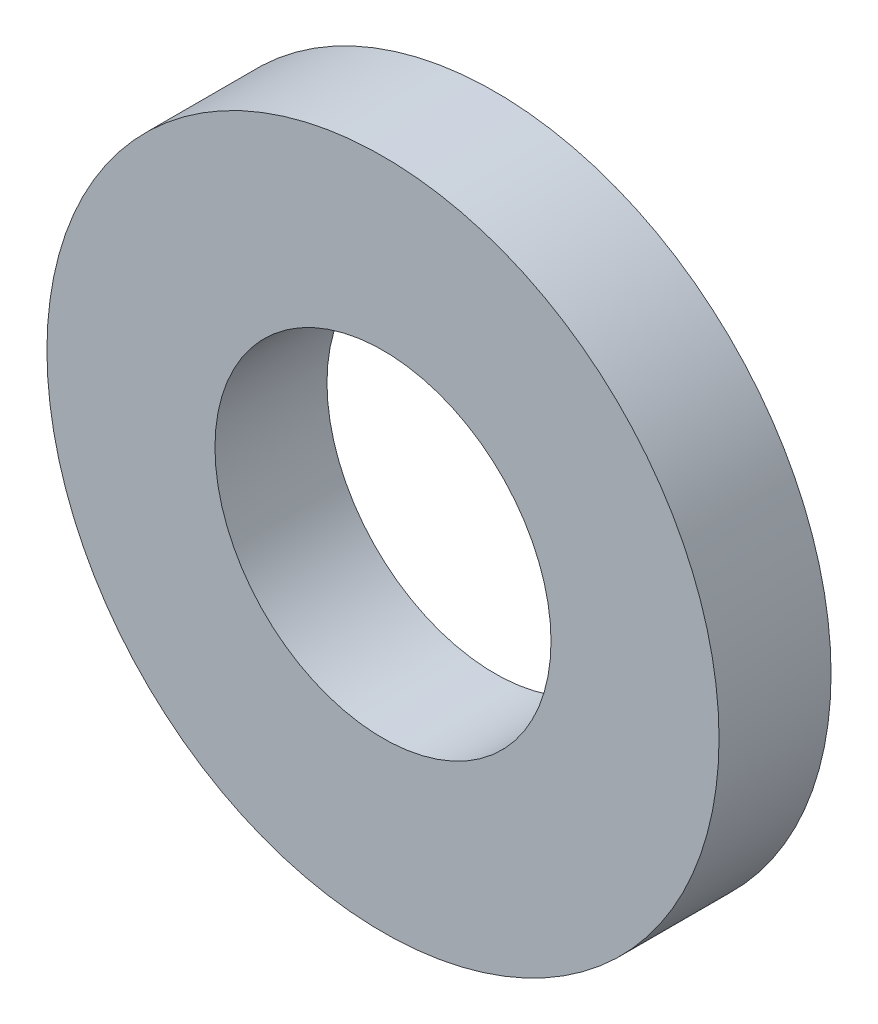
ISO-10303-21;
HEADER;
FILE_DESCRIPTION(('STEP AP214'),'2;1');
FILE_NAME('part.step','',(''),(''),'','','');
FILE_SCHEMA(('AUTOMOTIVE_DESIGN { 1 0 10303 214 1 1 1 1 }'));
ENDSEC;
DATA;
#1=APPLICATION_CONTEXT('core data for automotive mechanical design processes');
#2=APPLICATION_PROTOCOL_DEFINITION('international standard','automotive_design',2000,#1);
#3=PRODUCT_CONTEXT('',#1,'mechanical');
#4=PRODUCT('Part','Part','',(#3));
#5=PRODUCT_RELATED_PRODUCT_CATEGORY('part','',(#4));
#6=PRODUCT_DEFINITION_FORMATION('','',#4);
#7=PRODUCT_DEFINITION_CONTEXT('part definition',#1,'design');
#8=PRODUCT_DEFINITION('design','',#6,#7);
#9=PRODUCT_DEFINITION_SHAPE('','',#8);
#10=(LENGTH_UNIT() NAMED_UNIT(*) SI_UNIT(.MILLI.,.METRE.));
#11=(NAMED_UNIT(*) PLANE_ANGLE_UNIT() SI_UNIT($,.RADIAN.));
#12=(NAMED_UNIT(*) SI_UNIT($,.STERADIAN.) SOLID_ANGLE_UNIT());
#13=UNCERTAINTY_MEASURE_WITH_UNIT(LENGTH_MEASURE(1.E-05),#10,'distance_accuracy_value','');
#14=(GEOMETRIC_REPRESENTATION_CONTEXT(3) GLOBAL_UNCERTAINTY_ASSIGNED_CONTEXT((#13)) GLOBAL_UNIT_ASSIGNED_CONTEXT((#10,
#11,#12)) REPRESENTATION_CONTEXT('',''));
#15=CARTESIAN_POINT('',(0.,0.,0.));
#16=DIRECTION('',(0.,0.,1.));
#17=DIRECTION('',(1.,0.,0.));
#18=AXIS2_PLACEMENT_3D('',#15,#16,#17);
#19=CARTESIAN_POINT('',(0.,0.,-3.175));
#20=DIRECTION('',(0.,0.,1.));
#21=DIRECTION('',(1.,0.,0.));
#22=AXIS2_PLACEMENT_3D('',#19,#20,#21);
#23=CYLINDRICAL_SURFACE('',#22,9.525);
#24=CARTESIAN_POINT('',(0.,0.,-3.175));
#25=DIRECTION('',(0.,0.,1.));
#26=DIRECTION('',(1.,0.,0.));
#27=AXIS2_PLACEMENT_3D('',#24,#25,#26);
#28=CIRCLE('',#27,9.525);
#29=CARTESIAN_POINT('',(9.52500000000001,0.,-3.175));
#30=VERTEX_POINT('',#29);
#31=EDGE_CURVE('E10',#30,#30,#28,.T.);
#32=ORIENTED_EDGE('',*,*,#31,.T.);
#33=EDGE_LOOP('',(#32));
#34=FACE_BOUND('',#33,.T.);
#35=CARTESIAN_POINT('',(0.,0.,0.));
#36=DIRECTION('',(0.,0.,1.));
#37=DIRECTION('',(1.,0.,0.));
#38=AXIS2_PLACEMENT_3D('',#35,#36,#37);
#39=CIRCLE('',#38,9.525);
#40=CARTESIAN_POINT('',(9.52500000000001,0.,0.));
#41=VERTEX_POINT('',#40);
#42=EDGE_CURVE('E40',#41,#41,#39,.T.);
#43=ORIENTED_EDGE('',*,*,#42,.F.);
#44=EDGE_LOOP('',(#43));
#45=FACE_BOUND('',#44,.T.);
#46=ADVANCED_FACE('F34',(#34,#45),#23,.T.);
#47=CARTESIAN_POINT('',(0.,0.,-3.175));
#48=DIRECTION('',(0.,0.,1.));
#49=DIRECTION('',(1.,0.,0.));
#50=AXIS2_PLACEMENT_3D('',#47,#48,#49);
#51=PLANE('',#50);
#52=CARTESIAN_POINT('',(0.,0.,-3.175));
#53=DIRECTION('',(0.,0.,1.));
#54=DIRECTION('',(1.,0.,0.));
#55=AXIS2_PLACEMENT_3D('',#52,#53,#54);
#56=CIRCLE('',#55,4.7625);
#57=CARTESIAN_POINT('',(4.7625,0.,-3.175));
#58=VERTEX_POINT('',#57);
#59=EDGE_CURVE('E44',#58,#58,#56,.T.);
#60=ORIENTED_EDGE('',*,*,#59,.T.);
#61=EDGE_LOOP('',(#60));
#62=FACE_BOUND('',#61,.T.);
#63=ORIENTED_EDGE('',*,*,#31,.F.);
#64=EDGE_LOOP('',(#63));
#65=FACE_BOUND('',#64,.T.);
#66=ADVANCED_FACE('F58',(#62,#65),#51,.F.);
#67=CARTESIAN_POINT('',(0.,0.,0.));
#68=DIRECTION('',(0.,0.,1.));
#69=DIRECTION('',(1.,0.,0.));
#70=AXIS2_PLACEMENT_3D('',#67,#68,#69);
#71=PLANE('',#70);
#72=CARTESIAN_POINT('',(0.,0.,0.));
#73=DIRECTION('',(0.,0.,1.));
#74=DIRECTION('',(1.,0.,0.));
#75=AXIS2_PLACEMENT_3D('',#72,#73,#74);
#76=CIRCLE('',#75,4.7625);
#77=CARTESIAN_POINT('',(4.7625,0.,0.));
#78=VERTEX_POINT('',#77);
#79=EDGE_CURVE('E48',#78,#78,#76,.T.);
#80=ORIENTED_EDGE('',*,*,#79,.F.);
#81=EDGE_LOOP('',(#80));
#82=FACE_BOUND('',#81,.T.);
#83=ORIENTED_EDGE('',*,*,#42,.T.);
#84=EDGE_LOOP('',(#83));
#85=FACE_BOUND('',#84,.T.);
#86=ADVANCED_FACE('F56',(#82,#85),#71,.T.);
#87=CARTESIAN_POINT('',(0.,0.,-3.175));
#88=DIRECTION('',(0.,0.,1.));
#89=DIRECTION('',(1.,0.,0.));
#90=AXIS2_PLACEMENT_3D('',#87,#88,#89);
#91=CYLINDRICAL_SURFACE('',#90,4.7625);
#92=ORIENTED_EDGE('',*,*,#59,.F.);
#93=EDGE_LOOP('',(#92));
#94=FACE_BOUND('',#93,.T.);
#95=ORIENTED_EDGE('',*,*,#79,.T.);
#96=EDGE_LOOP('',(#95));
#97=FACE_BOUND('',#96,.T.);
#98=ADVANCED_FACE('F54',(#94,#97),#91,.F.);
#99=CLOSED_SHELL('',(#46,#66,#86,#98));
#100=MANIFOLD_SOLID_BREP('B2',#99);
#101=ADVANCED_BREP_SHAPE_REPRESENTATION('',(#18,#100),#14);
#102=SHAPE_DEFINITION_REPRESENTATION(#9,#101);
ENDSEC;
END-ISO-10303-21;
